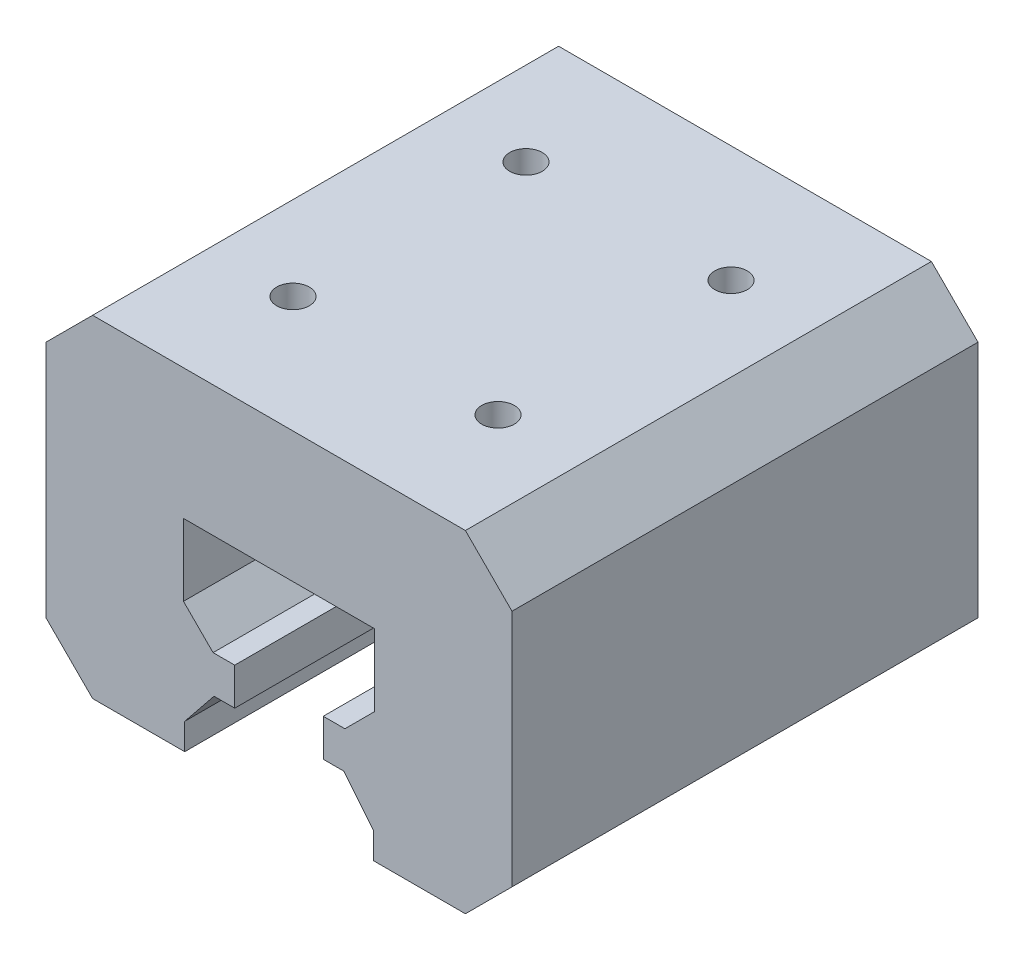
ISO-10303-21;
HEADER;
FILE_DESCRIPTION(('STEP AP214'),'2;1');
FILE_NAME('part.step','',(''),(''),'','','');
FILE_SCHEMA(('AUTOMOTIVE_DESIGN { 1 0 10303 214 1 1 1 1 }'));
ENDSEC;
DATA;
#1=APPLICATION_CONTEXT('core data for automotive mechanical design processes');
#2=APPLICATION_PROTOCOL_DEFINITION('international standard','automotive_design',2000,#1);
#3=PRODUCT_CONTEXT('',#1,'mechanical');
#4=PRODUCT('Part','Part','',(#3));
#5=PRODUCT_RELATED_PRODUCT_CATEGORY('part','',(#4));
#6=PRODUCT_DEFINITION_FORMATION('','',#4);
#7=PRODUCT_DEFINITION_CONTEXT('part definition',#1,'design');
#8=PRODUCT_DEFINITION('design','',#6,#7);
#9=PRODUCT_DEFINITION_SHAPE('','',#8);
#10=(LENGTH_UNIT() NAMED_UNIT(*) SI_UNIT(.MILLI.,.METRE.));
#11=(NAMED_UNIT(*) PLANE_ANGLE_UNIT() SI_UNIT($,.RADIAN.));
#12=(NAMED_UNIT(*) SI_UNIT($,.STERADIAN.) SOLID_ANGLE_UNIT());
#13=UNCERTAINTY_MEASURE_WITH_UNIT(LENGTH_MEASURE(1.E-05),#10,'distance_accuracy_value','');
#14=(GEOMETRIC_REPRESENTATION_CONTEXT(3) GLOBAL_UNCERTAINTY_ASSIGNED_CONTEXT((#13)) GLOBAL_UNIT_ASSIGNED_CONTEXT((#10,
#11,#12)) REPRESENTATION_CONTEXT('',''));
#15=CARTESIAN_POINT('',(0.,0.,0.));
#16=DIRECTION('',(0.,0.,1.));
#17=DIRECTION('',(1.,0.,0.));
#18=AXIS2_PLACEMENT_3D('',#15,#16,#17);
#19=CARTESIAN_POINT('',(31.192287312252,71.2311611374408,100.));
#20=DIRECTION('',(1.,0.,0.));
#21=DIRECTION('',(0.,0.,-1.));
#22=AXIS2_PLACEMENT_3D('',#19,#20,#21);
#23=PLANE('',#22);
#24=DIRECTION('',(0.,-1.,0.));
#25=VECTOR('',#24,1.);
#26=CARTESIAN_POINT('',(31.192287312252,71.2311611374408,100.));
#27=LINE('',#26,#25);
#28=CARTESIAN_POINT('',(31.192287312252,61.2311611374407,100.));
#29=VERTEX_POINT('',#28);
#30=CARTESIAN_POINT('',(31.192287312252,10.,100.));
#31=VERTEX_POINT('',#30);
#32=EDGE_CURVE('E240',#29,#31,#27,.T.);
#33=ORIENTED_EDGE('',*,*,#32,.T.);
#34=DIRECTION('',(0.,0.,-1.));
#35=VECTOR('',#34,1.);
#36=CARTESIAN_POINT('',(31.192287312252,9.99999999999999,100.));
#37=LINE('',#36,#35);
#38=CARTESIAN_POINT('',(31.192287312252,10.,0.));
#39=VERTEX_POINT('',#38);
#40=EDGE_CURVE('E407',#31,#39,#37,.T.);
#41=ORIENTED_EDGE('',*,*,#40,.T.);
#42=DIRECTION('',(0.,-1.,0.));
#43=VECTOR('',#42,1.);
#44=CARTESIAN_POINT('',(31.192287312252,71.2311611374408,0.));
#45=LINE('',#44,#43);
#46=CARTESIAN_POINT('',(31.192287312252,61.2311611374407,0.));
#47=VERTEX_POINT('',#46);
#48=EDGE_CURVE('E239',#47,#39,#45,.T.);
#49=ORIENTED_EDGE('',*,*,#48,.F.);
#50=DIRECTION('',(0.,0.,1.));
#51=VECTOR('',#50,1.);
#52=CARTESIAN_POINT('',(31.192287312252,61.2311611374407,100.));
#53=LINE('',#52,#51);
#54=EDGE_CURVE('E385',#47,#29,#53,.T.);
#55=ORIENTED_EDGE('',*,*,#54,.T.);
#56=EDGE_LOOP('',(#33,#41,#49,#55));
#57=FACE_BOUND('',#56,.T.);
#58=ADVANCED_FACE('F37',(#57),#23,.T.);
#59=CARTESIAN_POINT('',(31.192287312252,71.2311611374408,100.));
#60=DIRECTION('',(0.,-1.,0.));
#61=DIRECTION('',(1.,0.,0.));
#62=AXIS2_PLACEMENT_3D('',#59,#60,#61);
#63=PLANE('',#62);
#64=CARTESIAN_POINT('',(-40.807712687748,71.2311611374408,75.));
#65=DIRECTION('',(0.,1.,0.));
#66=DIRECTION('',(0.,0.,1.));
#67=AXIS2_PLACEMENT_3D('',#64,#65,#66);
#68=CIRCLE('',#67,3.5);
#69=CARTESIAN_POINT('',(-40.807712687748,71.2311611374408,78.5));
#70=VERTEX_POINT('',#69);
#71=EDGE_CURVE('E217',#70,#70,#68,.T.);
#72=ORIENTED_EDGE('',*,*,#71,.F.);
#73=EDGE_LOOP('',(#72));
#74=FACE_BOUND('',#73,.T.);
#75=CARTESIAN_POINT('',(3.19228731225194,71.2311611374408,75.));
#76=DIRECTION('',(0.,1.,0.));
#77=DIRECTION('',(0.,0.,1.));
#78=AXIS2_PLACEMENT_3D('',#75,#76,#77);
#79=CIRCLE('',#78,3.5);
#80=CARTESIAN_POINT('',(3.19228731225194,71.2311611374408,78.5));
#81=VERTEX_POINT('',#80);
#82=EDGE_CURVE('E216',#81,#81,#79,.T.);
#83=ORIENTED_EDGE('',*,*,#82,.F.);
#84=EDGE_LOOP('',(#83));
#85=FACE_BOUND('',#84,.T.);
#86=CARTESIAN_POINT('',(3.19228731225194,71.2311611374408,25.));
#87=DIRECTION('',(0.,1.,0.));
#88=DIRECTION('',(0.,0.,1.));
#89=AXIS2_PLACEMENT_3D('',#86,#87,#88);
#90=CIRCLE('',#89,3.5);
#91=CARTESIAN_POINT('',(3.19228731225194,71.2311611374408,28.5));
#92=VERTEX_POINT('',#91);
#93=EDGE_CURVE('E227',#92,#92,#90,.T.);
#94=ORIENTED_EDGE('',*,*,#93,.F.);
#95=EDGE_LOOP('',(#94));
#96=FACE_BOUND('',#95,.T.);
#97=CARTESIAN_POINT('',(-40.807712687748,71.2311611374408,25.));
#98=DIRECTION('',(0.,1.,0.));
#99=DIRECTION('',(0.,0.,1.));
#100=AXIS2_PLACEMENT_3D('',#97,#98,#99);
#101=CIRCLE('',#100,3.5);
#102=CARTESIAN_POINT('',(-40.807712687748,71.2311611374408,28.5));
#103=VERTEX_POINT('',#102);
#104=EDGE_CURVE('E233',#103,#103,#101,.T.);
#105=ORIENTED_EDGE('',*,*,#104,.F.);
#106=EDGE_LOOP('',(#105));
#107=FACE_BOUND('',#106,.T.);
#108=DIRECTION('',(-1.,0.,0.));
#109=VECTOR('',#108,1.);
#110=CARTESIAN_POINT('',(31.192287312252,71.2311611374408,0.));
#111=LINE('',#110,#109);
#112=CARTESIAN_POINT('',(21.192287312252,71.2311611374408,0.));
#113=VERTEX_POINT('',#112);
#114=CARTESIAN_POINT('',(-58.807712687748,71.2311611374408,0.));
#115=VERTEX_POINT('',#114);
#116=EDGE_CURVE('E244',#113,#115,#111,.T.);
#117=ORIENTED_EDGE('',*,*,#116,.T.);
#118=DIRECTION('',(0.,0.,1.));
#119=VECTOR('',#118,1.);
#120=CARTESIAN_POINT('',(-58.807712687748,71.2311611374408,100.));
#121=LINE('',#120,#119);
#122=CARTESIAN_POINT('',(-58.807712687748,71.2311611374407,100.));
#123=VERTEX_POINT('',#122);
#124=EDGE_CURVE('E394',#115,#123,#121,.T.);
#125=ORIENTED_EDGE('',*,*,#124,.T.);
#126=DIRECTION('',(-1.,0.,0.));
#127=VECTOR('',#126,1.);
#128=CARTESIAN_POINT('',(31.192287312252,71.2311611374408,100.));
#129=LINE('',#128,#127);
#130=CARTESIAN_POINT('',(21.192287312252,71.2311611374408,100.));
#131=VERTEX_POINT('',#130);
#132=EDGE_CURVE('E288',#131,#123,#129,.T.);
#133=ORIENTED_EDGE('',*,*,#132,.F.);
#134=DIRECTION('',(0.,0.,-1.));
#135=VECTOR('',#134,1.);
#136=CARTESIAN_POINT('',(21.192287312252,71.2311611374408,0.));
#137=LINE('',#136,#135);
#138=EDGE_CURVE('E343',#131,#113,#137,.T.);
#139=ORIENTED_EDGE('',*,*,#138,.T.);
#140=EDGE_LOOP('',(#117,#125,#133,#139));
#141=FACE_BOUND('',#140,.T.);
#142=ADVANCED_FACE('F425',(#74,#85,#96,#107,#141),#63,.F.);
#143=CARTESIAN_POINT('',(-68.807712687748,71.2311611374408,100.));
#144=DIRECTION('',(1.,0.,0.));
#145=DIRECTION('',(0.,1.,0.));
#146=AXIS2_PLACEMENT_3D('',#143,#144,#145);
#147=PLANE('',#146);
#148=DIRECTION('',(0.,-1.,0.));
#149=VECTOR('',#148,1.);
#150=CARTESIAN_POINT('',(-68.807712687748,71.2311611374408,0.));
#151=LINE('',#150,#149);
#152=CARTESIAN_POINT('',(-68.807712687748,61.2311611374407,0.));
#153=VERTEX_POINT('',#152);
#154=CARTESIAN_POINT('',(-68.807712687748,10.,0.));
#155=VERTEX_POINT('',#154);
#156=EDGE_CURVE('E335',#153,#155,#151,.T.);
#157=ORIENTED_EDGE('',*,*,#156,.T.);
#158=DIRECTION('',(0.,0.,1.));
#159=VECTOR('',#158,1.);
#160=CARTESIAN_POINT('',(-68.807712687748,10.,100.));
#161=LINE('',#160,#159);
#162=CARTESIAN_POINT('',(-68.807712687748,10.0000000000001,100.));
#163=VERTEX_POINT('',#162);
#164=EDGE_CURVE('E403',#155,#163,#161,.T.);
#165=ORIENTED_EDGE('',*,*,#164,.T.);
#166=DIRECTION('',(0.,-1.,0.));
#167=VECTOR('',#166,1.);
#168=CARTESIAN_POINT('',(-68.807712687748,71.2311611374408,100.));
#169=LINE('',#168,#167);
#170=CARTESIAN_POINT('',(-68.807712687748,61.2311611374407,100.));
#171=VERTEX_POINT('',#170);
#172=EDGE_CURVE('E285',#171,#163,#169,.T.);
#173=ORIENTED_EDGE('',*,*,#172,.F.);
#174=DIRECTION('',(0.,0.,-1.));
#175=VECTOR('',#174,1.);
#176=CARTESIAN_POINT('',(-68.807712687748,61.2311611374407,100.));
#177=LINE('',#176,#175);
#178=EDGE_CURVE('E389',#171,#153,#177,.T.);
#179=ORIENTED_EDGE('',*,*,#178,.T.);
#180=EDGE_LOOP('',(#157,#165,#173,#179));
#181=FACE_BOUND('',#180,.T.);
#182=ADVANCED_FACE('F436',(#181),#147,.F.);
#183=CARTESIAN_POINT('',(-68.807712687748,0.,100.));
#184=DIRECTION('',(0.,1.,0.));
#185=DIRECTION('',(0.,0.,1.));
#186=AXIS2_PLACEMENT_3D('',#183,#184,#185);
#187=PLANE('',#186);
#188=DIRECTION('',(1.,0.,0.));
#189=VECTOR('',#188,1.);
#190=CARTESIAN_POINT('',(-68.807712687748,0.,100.));
#191=LINE('',#190,#189);
#192=CARTESIAN_POINT('',(-58.807712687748,0.,100.));
#193=VERTEX_POINT('',#192);
#194=CARTESIAN_POINT('',(-39.0437937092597,0.,100.));
#195=VERTEX_POINT('',#194);
#196=EDGE_CURVE('E283',#193,#195,#191,.T.);
#197=ORIENTED_EDGE('',*,*,#196,.F.);
#198=DIRECTION('',(0.,0.,-1.));
#199=VECTOR('',#198,1.);
#200=CARTESIAN_POINT('',(-58.807712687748,0.,100.));
#201=LINE('',#200,#199);
#202=CARTESIAN_POINT('',(-58.807712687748,0.,0.));
#203=VERTEX_POINT('',#202);
#204=EDGE_CURVE('E398',#193,#203,#201,.T.);
#205=ORIENTED_EDGE('',*,*,#204,.T.);
#206=DIRECTION('',(1.,0.,0.));
#207=VECTOR('',#206,1.);
#208=CARTESIAN_POINT('',(-68.807712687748,0.,0.));
#209=LINE('',#208,#207);
#210=CARTESIAN_POINT('',(-39.0437937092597,0.,0.));
#211=VERTEX_POINT('',#210);
#212=EDGE_CURVE('E333',#203,#211,#209,.T.);
#213=ORIENTED_EDGE('',*,*,#212,.T.);
#214=DIRECTION('',(0.,0.,-1.));
#215=VECTOR('',#214,1.);
#216=CARTESIAN_POINT('',(-39.0437937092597,0.,100.));
#217=LINE('',#216,#215);
#218=EDGE_CURVE('E340',#195,#211,#217,.T.);
#219=ORIENTED_EDGE('',*,*,#218,.F.);
#220=EDGE_LOOP('',(#197,#205,#213,#219));
#221=FACE_BOUND('',#220,.T.);
#222=ADVANCED_FACE('F446',(#221),#187,.F.);
#223=CARTESIAN_POINT('',(-39.0437937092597,0.,100.));
#224=DIRECTION('',(-1.,0.,0.));
#225=DIRECTION('',(0.,0.,1.));
#226=AXIS2_PLACEMENT_3D('',#223,#224,#225);
#227=PLANE('',#226);
#228=DIRECTION('',(0.,1.,0.));
#229=VECTOR('',#228,1.);
#230=CARTESIAN_POINT('',(-39.0437937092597,0.,0.));
#231=LINE('',#230,#229);
#232=CARTESIAN_POINT('',(-39.0437937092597,5.64651643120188,0.));
#233=VERTEX_POINT('',#232);
#234=EDGE_CURVE('E331',#211,#233,#231,.T.);
#235=ORIENTED_EDGE('',*,*,#234,.T.);
#236=DIRECTION('',(0.,0.,-1.));
#237=VECTOR('',#236,1.);
#238=CARTESIAN_POINT('',(-39.0437937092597,5.64651643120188,100.));
#239=LINE('',#238,#237);
#240=CARTESIAN_POINT('',(-39.0437937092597,5.64651643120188,100.));
#241=VERTEX_POINT('',#240);
#242=EDGE_CURVE('E344',#241,#233,#239,.T.);
#243=ORIENTED_EDGE('',*,*,#242,.F.);
#244=DIRECTION('',(0.,1.,0.));
#245=VECTOR('',#244,1.);
#246=CARTESIAN_POINT('',(-39.0437937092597,0.,100.));
#247=LINE('',#246,#245);
#248=EDGE_CURVE('E281',#195,#241,#247,.T.);
#249=ORIENTED_EDGE('',*,*,#248,.F.);
#250=ORIENTED_EDGE('',*,*,#218,.T.);
#251=EDGE_LOOP('',(#235,#243,#249,#250));
#252=FACE_BOUND('',#251,.T.);
#253=ADVANCED_FACE('F453',(#252),#227,.F.);
#254=CARTESIAN_POINT('',(-39.0437937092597,5.64651643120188,100.));
#255=DIRECTION('',(-0.77901425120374,0.627006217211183,0.));
#256=DIRECTION('',(-0.627006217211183,-0.77901425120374,0.));
#257=AXIS2_PLACEMENT_3D('',#254,#255,#256);
#258=PLANE('',#257);
#259=DIRECTION('',(0.627006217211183,0.77901425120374,0.));
#260=VECTOR('',#259,1.);
#261=CARTESIAN_POINT('',(-39.0437937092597,5.64651643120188,0.));
#262=LINE('',#261,#260);
#263=CARTESIAN_POINT('',(-32.7533796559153,13.4619448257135,0.));
#264=VERTEX_POINT('',#263);
#265=EDGE_CURVE('E329',#233,#264,#262,.T.);
#266=ORIENTED_EDGE('',*,*,#265,.T.);
#267=DIRECTION('',(0.,0.,-1.));
#268=VECTOR('',#267,1.);
#269=CARTESIAN_POINT('',(-32.7533796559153,13.4619448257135,100.));
#270=LINE('',#269,#268);
#271=CARTESIAN_POINT('',(-32.7533796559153,13.4619448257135,100.));
#272=VERTEX_POINT('',#271);
#273=EDGE_CURVE('E347',#272,#264,#270,.T.);
#274=ORIENTED_EDGE('',*,*,#273,.F.);
#275=DIRECTION('',(0.627006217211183,0.77901425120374,0.));
#276=VECTOR('',#275,1.);
#277=CARTESIAN_POINT('',(-39.0437937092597,5.64651643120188,100.));
#278=LINE('',#277,#276);
#279=EDGE_CURVE('E279',#241,#272,#278,.T.);
#280=ORIENTED_EDGE('',*,*,#279,.F.);
#281=ORIENTED_EDGE('',*,*,#242,.T.);
#282=EDGE_LOOP('',(#266,#274,#280,#281));
#283=FACE_BOUND('',#282,.T.);
#284=ADVANCED_FACE('F456',(#283),#258,.F.);
#285=CARTESIAN_POINT('',(-32.7533796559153,13.4619448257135,100.));
#286=DIRECTION('',(0.,1.,0.));
#287=DIRECTION('',(-1.,0.,0.));
#288=AXIS2_PLACEMENT_3D('',#285,#286,#287);
#289=PLANE('',#288);
#290=DIRECTION('',(1.,0.,0.));
#291=VECTOR('',#290,1.);
#292=CARTESIAN_POINT('',(-32.7533796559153,13.4619448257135,0.));
#293=LINE('',#292,#291);
#294=CARTESIAN_POINT('',(-28.307712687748,13.4619448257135,0.));
#295=VERTEX_POINT('',#294);
#296=EDGE_CURVE('E327',#264,#295,#293,.T.);
#297=ORIENTED_EDGE('',*,*,#296,.T.);
#298=DIRECTION('',(0.,0.,-1.));
#299=VECTOR('',#298,1.);
#300=CARTESIAN_POINT('',(-28.307712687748,13.4619448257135,100.));
#301=LINE('',#300,#299);
#302=CARTESIAN_POINT('',(-28.307712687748,13.4619448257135,100.));
#303=VERTEX_POINT('',#302);
#304=EDGE_CURVE('E350',#303,#295,#301,.T.);
#305=ORIENTED_EDGE('',*,*,#304,.F.);
#306=DIRECTION('',(1.,0.,0.));
#307=VECTOR('',#306,1.);
#308=CARTESIAN_POINT('',(-32.7533796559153,13.4619448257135,100.));
#309=LINE('',#308,#307);
#310=EDGE_CURVE('E277',#272,#303,#309,.T.);
#311=ORIENTED_EDGE('',*,*,#310,.F.);
#312=ORIENTED_EDGE('',*,*,#273,.T.);
#313=EDGE_LOOP('',(#297,#305,#311,#312));
#314=FACE_BOUND('',#313,.T.);
#315=ADVANCED_FACE('F461',(#314),#289,.F.);
#316=CARTESIAN_POINT('',(-28.307712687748,13.4619448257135,100.));
#317=DIRECTION('',(-1.,0.,0.));
#318=DIRECTION('',(0.,-1.,0.));
#319=AXIS2_PLACEMENT_3D('',#316,#317,#318);
#320=PLANE('',#319);
#321=DIRECTION('',(0.,1.,0.));
#322=VECTOR('',#321,1.);
#323=CARTESIAN_POINT('',(-28.307712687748,13.4619448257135,0.));
#324=LINE('',#323,#322);
#325=CARTESIAN_POINT('',(-28.307712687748,21.4619448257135,0.));
#326=VERTEX_POINT('',#325);
#327=EDGE_CURVE('E325',#295,#326,#324,.T.);
#328=ORIENTED_EDGE('',*,*,#327,.T.);
#329=DIRECTION('',(0.,0.,-1.));
#330=VECTOR('',#329,1.);
#331=CARTESIAN_POINT('',(-28.307712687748,21.4619448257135,100.));
#332=LINE('',#331,#330);
#333=CARTESIAN_POINT('',(-28.307712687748,21.4619448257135,100.));
#334=VERTEX_POINT('',#333);
#335=EDGE_CURVE('E353',#334,#326,#332,.T.);
#336=ORIENTED_EDGE('',*,*,#335,.F.);
#337=DIRECTION('',(0.,1.,0.));
#338=VECTOR('',#337,1.);
#339=CARTESIAN_POINT('',(-28.307712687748,13.4619448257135,100.));
#340=LINE('',#339,#338);
#341=EDGE_CURVE('E275',#303,#334,#340,.T.);
#342=ORIENTED_EDGE('',*,*,#341,.F.);
#343=ORIENTED_EDGE('',*,*,#304,.T.);
#344=EDGE_LOOP('',(#328,#336,#342,#343));
#345=FACE_BOUND('',#344,.T.);
#346=ADVANCED_FACE('F467',(#345),#320,.F.);
#347=CARTESIAN_POINT('',(-28.307712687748,21.4619448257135,100.));
#348=DIRECTION('',(0.,-1.,0.));
#349=DIRECTION('',(1.,0.,0.));
#350=AXIS2_PLACEMENT_3D('',#347,#348,#349);
#351=PLANE('',#350);
#352=DIRECTION('',(-1.,0.,0.));
#353=VECTOR('',#352,1.);
#354=CARTESIAN_POINT('',(-28.307712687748,21.4619448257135,0.));
#355=LINE('',#354,#353);
#356=CARTESIAN_POINT('',(-32.9527099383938,21.4619448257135,0.));
#357=VERTEX_POINT('',#356);
#358=EDGE_CURVE('E323',#326,#357,#355,.T.);
#359=ORIENTED_EDGE('',*,*,#358,.T.);
#360=DIRECTION('',(0.,0.,-1.));
#361=VECTOR('',#360,1.);
#362=CARTESIAN_POINT('',(-32.9527099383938,21.4619448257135,100.));
#363=LINE('',#362,#361);
#364=CARTESIAN_POINT('',(-32.9527099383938,21.4619448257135,100.));
#365=VERTEX_POINT('',#364);
#366=EDGE_CURVE('E356',#365,#357,#363,.T.);
#367=ORIENTED_EDGE('',*,*,#366,.F.);
#368=DIRECTION('',(-1.,0.,0.));
#369=VECTOR('',#368,1.);
#370=CARTESIAN_POINT('',(-28.307712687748,21.4619448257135,100.));
#371=LINE('',#370,#369);
#372=EDGE_CURVE('E273',#334,#365,#371,.T.);
#373=ORIENTED_EDGE('',*,*,#372,.F.);
#374=ORIENTED_EDGE('',*,*,#335,.T.);
#375=EDGE_LOOP('',(#359,#367,#373,#374));
#376=FACE_BOUND('',#375,.T.);
#377=ADVANCED_FACE('F471',(#376),#351,.F.);
#378=CARTESIAN_POINT('',(-32.9527099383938,21.4619448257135,100.));
#379=DIRECTION('',(-0.707106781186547,-0.707106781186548,0.));
#380=DIRECTION('',(0.707106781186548,-0.707106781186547,0.));
#381=AXIS2_PLACEMENT_3D('',#378,#379,#380);
#382=PLANE('',#381);
#383=DIRECTION('',(-0.707106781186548,0.707106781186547,0.));
#384=VECTOR('',#383,1.);
#385=CARTESIAN_POINT('',(-32.9527099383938,21.4619448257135,0.));
#386=LINE('',#385,#384);
#387=CARTESIAN_POINT('',(-39.307712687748,27.8169475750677,0.));
#388=VERTEX_POINT('',#387);
#389=EDGE_CURVE('E321',#357,#388,#386,.T.);
#390=ORIENTED_EDGE('',*,*,#389,.T.);
#391=DIRECTION('',(0.,0.,-1.));
#392=VECTOR('',#391,1.);
#393=CARTESIAN_POINT('',(-39.307712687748,27.8169475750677,100.));
#394=LINE('',#393,#392);
#395=CARTESIAN_POINT('',(-39.307712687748,27.8169475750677,100.));
#396=VERTEX_POINT('',#395);
#397=EDGE_CURVE('E359',#396,#388,#394,.T.);
#398=ORIENTED_EDGE('',*,*,#397,.F.);
#399=DIRECTION('',(-0.707106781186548,0.707106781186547,0.));
#400=VECTOR('',#399,1.);
#401=CARTESIAN_POINT('',(-32.9527099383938,21.4619448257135,100.));
#402=LINE('',#401,#400);
#403=EDGE_CURVE('E271',#365,#396,#402,.T.);
#404=ORIENTED_EDGE('',*,*,#403,.F.);
#405=ORIENTED_EDGE('',*,*,#366,.T.);
#406=EDGE_LOOP('',(#390,#398,#404,#405));
#407=FACE_BOUND('',#406,.T.);
#408=ADVANCED_FACE('F476',(#407),#382,.F.);
#409=CARTESIAN_POINT('',(-39.307712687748,27.8169475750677,100.));
#410=DIRECTION('',(-1.,0.,0.));
#411=DIRECTION('',(0.,-1.,0.));
#412=AXIS2_PLACEMENT_3D('',#409,#410,#411);
#413=PLANE('',#412);
#414=DIRECTION('',(0.,1.,0.));
#415=VECTOR('',#414,1.);
#416=CARTESIAN_POINT('',(-39.307712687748,27.8169475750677,0.));
#417=LINE('',#416,#415);
#418=CARTESIAN_POINT('',(-39.307712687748,43.2311611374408,0.));
#419=VERTEX_POINT('',#418);
#420=EDGE_CURVE('E319',#388,#419,#417,.T.);
#421=ORIENTED_EDGE('',*,*,#420,.T.);
#422=DIRECTION('',(0.,0.,-1.));
#423=VECTOR('',#422,1.);
#424=CARTESIAN_POINT('',(-39.307712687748,43.2311611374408,100.));
#425=LINE('',#424,#423);
#426=CARTESIAN_POINT('',(-39.307712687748,43.2311611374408,100.));
#427=VERTEX_POINT('',#426);
#428=EDGE_CURVE('E362',#427,#419,#425,.T.);
#429=ORIENTED_EDGE('',*,*,#428,.F.);
#430=DIRECTION('',(0.,1.,0.));
#431=VECTOR('',#430,1.);
#432=CARTESIAN_POINT('',(-39.307712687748,27.8169475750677,100.));
#433=LINE('',#432,#431);
#434=EDGE_CURVE('E269',#396,#427,#433,.T.);
#435=ORIENTED_EDGE('',*,*,#434,.F.);
#436=ORIENTED_EDGE('',*,*,#397,.T.);
#437=EDGE_LOOP('',(#421,#429,#435,#436));
#438=FACE_BOUND('',#437,.T.);
#439=ADVANCED_FACE('F483',(#438),#413,.F.);
#440=CARTESIAN_POINT('',(-39.307712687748,43.2311611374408,100.));
#441=DIRECTION('',(0.,1.,0.));
#442=DIRECTION('',(-1.,0.,0.));
#443=AXIS2_PLACEMENT_3D('',#440,#441,#442);
#444=PLANE('',#443);
#445=DIRECTION('',(1.,0.,0.));
#446=VECTOR('',#445,1.);
#447=CARTESIAN_POINT('',(-39.307712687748,43.2311611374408,0.));
#448=LINE('',#447,#446);
#449=CARTESIAN_POINT('',(1.69228731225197,43.2311611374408,0.));
#450=VERTEX_POINT('',#449);
#451=EDGE_CURVE('E316',#419,#450,#448,.T.);
#452=ORIENTED_EDGE('',*,*,#451,.T.);
#453=DIRECTION('',(0.,0.,-1.));
#454=VECTOR('',#453,1.);
#455=CARTESIAN_POINT('',(1.69228731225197,43.2311611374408,100.));
#456=LINE('',#455,#454);
#457=CARTESIAN_POINT('',(1.69228731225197,43.2311611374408,100.));
#458=VERTEX_POINT('',#457);
#459=EDGE_CURVE('E365',#458,#450,#456,.T.);
#460=ORIENTED_EDGE('',*,*,#459,.F.);
#461=DIRECTION('',(1.,0.,0.));
#462=VECTOR('',#461,1.);
#463=CARTESIAN_POINT('',(-39.307712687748,43.2311611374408,100.));
#464=LINE('',#463,#462);
#465=EDGE_CURVE('E267',#427,#458,#464,.T.);
#466=ORIENTED_EDGE('',*,*,#465,.F.);
#467=ORIENTED_EDGE('',*,*,#428,.T.);
#468=EDGE_LOOP('',(#452,#460,#466,#467));
#469=FACE_BOUND('',#468,.T.);
#470=ADVANCED_FACE('F487',(#469),#444,.F.);
#471=CARTESIAN_POINT('',(1.69228731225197,27.8169475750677,100.));
#472=DIRECTION('',(-1.,0.,0.));
#473=DIRECTION('',(0.,0.,1.));
#474=AXIS2_PLACEMENT_3D('',#471,#472,#473);
#475=PLANE('',#474);
#476=DIRECTION('',(0.,1.,0.));
#477=VECTOR('',#476,1.);
#478=CARTESIAN_POINT('',(1.69228731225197,27.8169475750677,0.));
#479=LINE('',#478,#477);
#480=CARTESIAN_POINT('',(1.69228731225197,27.8169475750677,0.));
#481=VERTEX_POINT('',#480);
#482=EDGE_CURVE('E313',#481,#450,#479,.T.);
#483=ORIENTED_EDGE('',*,*,#482,.F.);
#484=DIRECTION('',(0.,0.,-1.));
#485=VECTOR('',#484,1.);
#486=CARTESIAN_POINT('',(1.69228731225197,27.8169475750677,100.));
#487=LINE('',#486,#485);
#488=CARTESIAN_POINT('',(1.69228731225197,27.8169475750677,100.));
#489=VERTEX_POINT('',#488);
#490=EDGE_CURVE('E367',#489,#481,#487,.T.);
#491=ORIENTED_EDGE('',*,*,#490,.F.);
#492=DIRECTION('',(0.,1.,0.));
#493=VECTOR('',#492,1.);
#494=CARTESIAN_POINT('',(1.69228731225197,27.8169475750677,100.));
#495=LINE('',#494,#493);
#496=EDGE_CURVE('E264',#489,#458,#495,.T.);
#497=ORIENTED_EDGE('',*,*,#496,.T.);
#498=ORIENTED_EDGE('',*,*,#459,.T.);
#499=EDGE_LOOP('',(#483,#491,#497,#498));
#500=FACE_BOUND('',#499,.T.);
#501=ADVANCED_FACE('F490',(#500),#475,.T.);
#502=CARTESIAN_POINT('',(-4.66271543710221,21.4619448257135,100.));
#503=DIRECTION('',(-0.707106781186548,0.707106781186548,0.));
#504=DIRECTION('',(-0.707106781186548,-0.707106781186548,0.));
#505=AXIS2_PLACEMENT_3D('',#502,#503,#504);
#506=PLANE('',#505);
#507=DIRECTION('',(0.707106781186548,0.707106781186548,0.));
#508=VECTOR('',#507,1.);
#509=CARTESIAN_POINT('',(-4.66271543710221,21.4619448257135,0.));
#510=LINE('',#509,#508);
#511=CARTESIAN_POINT('',(-4.66271543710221,21.4619448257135,0.));
#512=VERTEX_POINT('',#511);
#513=EDGE_CURVE('E310',#512,#481,#510,.T.);
#514=ORIENTED_EDGE('',*,*,#513,.F.);
#515=DIRECTION('',(0.,0.,-1.));
#516=VECTOR('',#515,1.);
#517=CARTESIAN_POINT('',(-4.66271543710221,21.4619448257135,100.));
#518=LINE('',#517,#516);
#519=CARTESIAN_POINT('',(-4.66271543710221,21.4619448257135,100.));
#520=VERTEX_POINT('',#519);
#521=EDGE_CURVE('E369',#520,#512,#518,.T.);
#522=ORIENTED_EDGE('',*,*,#521,.F.);
#523=DIRECTION('',(0.707106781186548,0.707106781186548,0.));
#524=VECTOR('',#523,1.);
#525=CARTESIAN_POINT('',(-4.66271543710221,21.4619448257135,100.));
#526=LINE('',#525,#524);
#527=EDGE_CURVE('E261',#520,#489,#526,.T.);
#528=ORIENTED_EDGE('',*,*,#527,.T.);
#529=ORIENTED_EDGE('',*,*,#490,.T.);
#530=EDGE_LOOP('',(#514,#522,#528,#529));
#531=FACE_BOUND('',#530,.T.);
#532=ADVANCED_FACE('F495',(#531),#506,.T.);
#533=CARTESIAN_POINT('',(-9.30771268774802,21.4619448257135,100.));
#534=DIRECTION('',(0.,1.,0.));
#535=DIRECTION('',(0.,0.,1.));
#536=AXIS2_PLACEMENT_3D('',#533,#534,#535);
#537=PLANE('',#536);
#538=DIRECTION('',(1.,0.,0.));
#539=VECTOR('',#538,1.);
#540=CARTESIAN_POINT('',(-9.30771268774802,21.4619448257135,0.));
#541=LINE('',#540,#539);
#542=CARTESIAN_POINT('',(-9.30771268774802,21.4619448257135,0.));
#543=VERTEX_POINT('',#542);
#544=EDGE_CURVE('E307',#543,#512,#541,.T.);
#545=ORIENTED_EDGE('',*,*,#544,.F.);
#546=DIRECTION('',(0.,0.,-1.));
#547=VECTOR('',#546,1.);
#548=CARTESIAN_POINT('',(-9.30771268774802,21.4619448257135,100.));
#549=LINE('',#548,#547);
#550=CARTESIAN_POINT('',(-9.30771268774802,21.4619448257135,100.));
#551=VERTEX_POINT('',#550);
#552=EDGE_CURVE('E371',#551,#543,#549,.T.);
#553=ORIENTED_EDGE('',*,*,#552,.F.);
#554=DIRECTION('',(1.,0.,0.));
#555=VECTOR('',#554,1.);
#556=CARTESIAN_POINT('',(-9.30771268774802,21.4619448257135,100.));
#557=LINE('',#556,#555);
#558=EDGE_CURVE('E258',#551,#520,#557,.T.);
#559=ORIENTED_EDGE('',*,*,#558,.T.);
#560=ORIENTED_EDGE('',*,*,#521,.T.);
#561=EDGE_LOOP('',(#545,#553,#559,#560));
#562=FACE_BOUND('',#561,.T.);
#563=ADVANCED_FACE('F498',(#562),#537,.T.);
#564=CARTESIAN_POINT('',(-9.30771268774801,13.4619448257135,100.));
#565=DIRECTION('',(-1.,0.,0.));
#566=DIRECTION('',(0.,-1.,0.));
#567=AXIS2_PLACEMENT_3D('',#564,#565,#566);
#568=PLANE('',#567);
#569=DIRECTION('',(0.,1.,0.));
#570=VECTOR('',#569,1.);
#571=CARTESIAN_POINT('',(-9.30771268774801,13.4619448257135,0.));
#572=LINE('',#571,#570);
#573=CARTESIAN_POINT('',(-9.30771268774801,13.4619448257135,0.));
#574=VERTEX_POINT('',#573);
#575=EDGE_CURVE('E304',#574,#543,#572,.T.);
#576=ORIENTED_EDGE('',*,*,#575,.F.);
#577=DIRECTION('',(0.,0.,-1.));
#578=VECTOR('',#577,1.);
#579=CARTESIAN_POINT('',(-9.30771268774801,13.4619448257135,100.));
#580=LINE('',#579,#578);
#581=CARTESIAN_POINT('',(-9.30771268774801,13.4619448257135,100.));
#582=VERTEX_POINT('',#581);
#583=EDGE_CURVE('E373',#582,#574,#580,.T.);
#584=ORIENTED_EDGE('',*,*,#583,.F.);
#585=DIRECTION('',(0.,1.,0.));
#586=VECTOR('',#585,1.);
#587=CARTESIAN_POINT('',(-9.30771268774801,13.4619448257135,100.));
#588=LINE('',#587,#586);
#589=EDGE_CURVE('E255',#582,#551,#588,.T.);
#590=ORIENTED_EDGE('',*,*,#589,.T.);
#591=ORIENTED_EDGE('',*,*,#552,.T.);
#592=EDGE_LOOP('',(#576,#584,#590,#591));
#593=FACE_BOUND('',#592,.T.);
#594=ADVANCED_FACE('F503',(#593),#568,.T.);
#595=CARTESIAN_POINT('',(-4.86204571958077,13.4619448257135,100.));
#596=DIRECTION('',(0.,-1.,0.));
#597=DIRECTION('',(1.,0.,0.));
#598=AXIS2_PLACEMENT_3D('',#595,#596,#597);
#599=PLANE('',#598);
#600=DIRECTION('',(-1.,0.,0.));
#601=VECTOR('',#600,1.);
#602=CARTESIAN_POINT('',(-4.86204571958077,13.4619448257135,0.));
#603=LINE('',#602,#601);
#604=CARTESIAN_POINT('',(-4.86204571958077,13.4619448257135,0.));
#605=VERTEX_POINT('',#604);
#606=EDGE_CURVE('E301',#605,#574,#603,.T.);
#607=ORIENTED_EDGE('',*,*,#606,.F.);
#608=DIRECTION('',(0.,0.,-1.));
#609=VECTOR('',#608,1.);
#610=CARTESIAN_POINT('',(-4.86204571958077,13.4619448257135,100.));
#611=LINE('',#610,#609);
#612=CARTESIAN_POINT('',(-4.86204571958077,13.4619448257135,100.));
#613=VERTEX_POINT('',#612);
#614=EDGE_CURVE('E375',#613,#605,#611,.T.);
#615=ORIENTED_EDGE('',*,*,#614,.F.);
#616=DIRECTION('',(-1.,0.,0.));
#617=VECTOR('',#616,1.);
#618=CARTESIAN_POINT('',(-4.86204571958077,13.4619448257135,100.));
#619=LINE('',#618,#617);
#620=EDGE_CURVE('E252',#613,#582,#619,.T.);
#621=ORIENTED_EDGE('',*,*,#620,.T.);
#622=ORIENTED_EDGE('',*,*,#583,.T.);
#623=EDGE_LOOP('',(#607,#615,#621,#622));
#624=FACE_BOUND('',#623,.T.);
#625=ADVANCED_FACE('F506',(#624),#599,.T.);
#626=CARTESIAN_POINT('',(1.42836833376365,5.64651643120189,100.));
#627=DIRECTION('',(-0.779014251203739,-0.627006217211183,0.));
#628=DIRECTION('',(0.627006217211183,-0.779014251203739,0.));
#629=AXIS2_PLACEMENT_3D('',#626,#627,#628);
#630=PLANE('',#629);
#631=DIRECTION('',(-0.627006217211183,0.779014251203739,0.));
#632=VECTOR('',#631,1.);
#633=CARTESIAN_POINT('',(1.42836833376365,5.64651643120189,0.));
#634=LINE('',#633,#632);
#635=CARTESIAN_POINT('',(1.42836833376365,5.64651643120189,0.));
#636=VERTEX_POINT('',#635);
#637=EDGE_CURVE('E298',#636,#605,#634,.T.);
#638=ORIENTED_EDGE('',*,*,#637,.F.);
#639=DIRECTION('',(0.,0.,-1.));
#640=VECTOR('',#639,1.);
#641=CARTESIAN_POINT('',(1.42836833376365,5.64651643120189,100.));
#642=LINE('',#641,#640);
#643=CARTESIAN_POINT('',(1.42836833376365,5.64651643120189,100.));
#644=VERTEX_POINT('',#643);
#645=EDGE_CURVE('E377',#644,#636,#642,.T.);
#646=ORIENTED_EDGE('',*,*,#645,.F.);
#647=DIRECTION('',(-0.627006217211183,0.779014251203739,0.));
#648=VECTOR('',#647,1.);
#649=CARTESIAN_POINT('',(1.42836833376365,5.64651643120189,100.));
#650=LINE('',#649,#648);
#651=EDGE_CURVE('E249',#644,#613,#650,.T.);
#652=ORIENTED_EDGE('',*,*,#651,.T.);
#653=ORIENTED_EDGE('',*,*,#614,.T.);
#654=EDGE_LOOP('',(#638,#646,#652,#653));
#655=FACE_BOUND('',#654,.T.);
#656=ADVANCED_FACE('F511',(#655),#630,.T.);
#657=CARTESIAN_POINT('',(1.42836833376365,0.,100.));
#658=DIRECTION('',(-1.,0.,0.));
#659=DIRECTION('',(0.,0.,1.));
#660=AXIS2_PLACEMENT_3D('',#657,#658,#659);
#661=PLANE('',#660);
#662=DIRECTION('',(0.,1.,0.));
#663=VECTOR('',#662,1.);
#664=CARTESIAN_POINT('',(1.42836833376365,0.,0.));
#665=LINE('',#664,#663);
#666=CARTESIAN_POINT('',(1.42836833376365,0.,0.));
#667=VERTEX_POINT('',#666);
#668=EDGE_CURVE('E295',#667,#636,#665,.T.);
#669=ORIENTED_EDGE('',*,*,#668,.F.);
#670=DIRECTION('',(0.,0.,-1.));
#671=VECTOR('',#670,1.);
#672=CARTESIAN_POINT('',(1.42836833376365,0.,100.));
#673=LINE('',#672,#671);
#674=CARTESIAN_POINT('',(1.42836833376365,0.,100.));
#675=VERTEX_POINT('',#674);
#676=EDGE_CURVE('E291',#675,#667,#673,.T.);
#677=ORIENTED_EDGE('',*,*,#676,.F.);
#678=DIRECTION('',(0.,1.,0.));
#679=VECTOR('',#678,1.);
#680=CARTESIAN_POINT('',(1.42836833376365,0.,100.));
#681=LINE('',#680,#679);
#682=EDGE_CURVE('E246',#675,#644,#681,.T.);
#683=ORIENTED_EDGE('',*,*,#682,.T.);
#684=ORIENTED_EDGE('',*,*,#645,.T.);
#685=EDGE_LOOP('',(#669,#677,#683,#684));
#686=FACE_BOUND('',#685,.T.);
#687=ADVANCED_FACE('F514',(#686),#661,.T.);
#688=CARTESIAN_POINT('',(31.192287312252,0.,100.));
#689=DIRECTION('',(0.,-1.,0.));
#690=DIRECTION('',(1.,0.,0.));
#691=AXIS2_PLACEMENT_3D('',#688,#689,#690);
#692=PLANE('',#691);
#693=DIRECTION('',(-1.,0.,0.));
#694=VECTOR('',#693,1.);
#695=CARTESIAN_POINT('',(31.192287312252,0.,0.));
#696=LINE('',#695,#694);
#697=CARTESIAN_POINT('',(21.1922873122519,0.,0.));
#698=VERTEX_POINT('',#697);
#699=EDGE_CURVE('E293',#698,#667,#696,.T.);
#700=ORIENTED_EDGE('',*,*,#699,.F.);
#701=DIRECTION('',(0.,0.,1.));
#702=VECTOR('',#701,1.);
#703=CARTESIAN_POINT('',(21.1922873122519,0.,100.));
#704=LINE('',#703,#702);
#705=CARTESIAN_POINT('',(21.1922873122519,0.,100.));
#706=VERTEX_POINT('',#705);
#707=EDGE_CURVE('E45',#698,#706,#704,.T.);
#708=ORIENTED_EDGE('',*,*,#707,.T.);
#709=DIRECTION('',(-1.,0.,0.));
#710=VECTOR('',#709,1.);
#711=CARTESIAN_POINT('',(31.192287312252,0.,100.));
#712=LINE('',#711,#710);
#713=EDGE_CURVE('E243',#706,#675,#712,.T.);
#714=ORIENTED_EDGE('',*,*,#713,.T.);
#715=ORIENTED_EDGE('',*,*,#676,.T.);
#716=EDGE_LOOP('',(#700,#708,#714,#715));
#717=FACE_BOUND('',#716,.T.);
#718=ADVANCED_FACE('F534',(#717),#692,.T.);
#719=CARTESIAN_POINT('',(0.,0.,100.));
#720=DIRECTION('',(0.,0.,-1.));
#721=DIRECTION('',(-1.,0.,0.));
#722=AXIS2_PLACEMENT_3D('',#719,#720,#721);
#723=PLANE('',#722);
#724=ORIENTED_EDGE('',*,*,#713,.F.);
#725=DIRECTION('',(-0.707106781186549,-0.707106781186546,0.));
#726=VECTOR('',#725,1.);
#727=CARTESIAN_POINT('',(31.192287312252,9.99999999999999,100.));
#728=LINE('',#727,#726);
#729=EDGE_CURVE('E11',#706,#31,#728,.F.);
#730=ORIENTED_EDGE('',*,*,#729,.T.);
#731=ORIENTED_EDGE('',*,*,#32,.F.);
#732=DIRECTION('',(-0.707106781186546,0.707106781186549,0.));
#733=VECTOR('',#732,1.);
#734=CARTESIAN_POINT('',(21.192287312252,71.2311611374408,100.));
#735=LINE('',#734,#733);
#736=EDGE_CURVE('E387',#29,#131,#735,.T.);
#737=ORIENTED_EDGE('',*,*,#736,.T.);
#738=ORIENTED_EDGE('',*,*,#132,.T.);
#739=DIRECTION('',(0.707106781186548,0.707106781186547,0.));
#740=VECTOR('',#739,1.);
#741=CARTESIAN_POINT('',(-68.807712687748,61.2311611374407,100.));
#742=LINE('',#741,#740);
#743=EDGE_CURVE('E396',#123,#171,#742,.F.);
#744=ORIENTED_EDGE('',*,*,#743,.T.);
#745=ORIENTED_EDGE('',*,*,#172,.T.);
#746=DIRECTION('',(-0.707106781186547,0.707106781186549,0.));
#747=VECTOR('',#746,1.);
#748=CARTESIAN_POINT('',(-58.807712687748,0.,100.));
#749=LINE('',#748,#747);
#750=EDGE_CURVE('E405',#163,#193,#749,.F.);
#751=ORIENTED_EDGE('',*,*,#750,.T.);
#752=ORIENTED_EDGE('',*,*,#196,.T.);
#753=ORIENTED_EDGE('',*,*,#248,.T.);
#754=ORIENTED_EDGE('',*,*,#279,.T.);
#755=ORIENTED_EDGE('',*,*,#310,.T.);
#756=ORIENTED_EDGE('',*,*,#341,.T.);
#757=ORIENTED_EDGE('',*,*,#372,.T.);
#758=ORIENTED_EDGE('',*,*,#403,.T.);
#759=ORIENTED_EDGE('',*,*,#434,.T.);
#760=ORIENTED_EDGE('',*,*,#465,.T.);
#761=ORIENTED_EDGE('',*,*,#496,.F.);
#762=ORIENTED_EDGE('',*,*,#527,.F.);
#763=ORIENTED_EDGE('',*,*,#558,.F.);
#764=ORIENTED_EDGE('',*,*,#589,.F.);
#765=ORIENTED_EDGE('',*,*,#620,.F.);
#766=ORIENTED_EDGE('',*,*,#651,.F.);
#767=ORIENTED_EDGE('',*,*,#682,.F.);
#768=EDGE_LOOP('',(#724,#730,#731,#737,#738,#744,#745,#751,#752,#753,#754,#755,#756,#757,#758,
#759,#760,#761,#762,#763,#764,#765,#766,#767));
#769=FACE_BOUND('',#768,.T.);
#770=ADVANCED_FACE('F429',(#769),#723,.F.);
#771=CARTESIAN_POINT('',(0.,0.,0.));
#772=DIRECTION('',(0.,0.,-1.));
#773=DIRECTION('',(-1.,0.,0.));
#774=AXIS2_PLACEMENT_3D('',#771,#772,#773);
#775=PLANE('',#774);
#776=ORIENTED_EDGE('',*,*,#48,.T.);
#777=DIRECTION('',(0.707106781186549,0.707106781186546,0.));
#778=VECTOR('',#777,1.);
#779=CARTESIAN_POINT('',(10.5961436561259,-10.596143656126,0.));
#780=LINE('',#779,#778);
#781=EDGE_CURVE('E59',#39,#698,#780,.F.);
#782=ORIENTED_EDGE('',*,*,#781,.T.);
#783=ORIENTED_EDGE('',*,*,#699,.T.);
#784=ORIENTED_EDGE('',*,*,#668,.T.);
#785=ORIENTED_EDGE('',*,*,#637,.T.);
#786=ORIENTED_EDGE('',*,*,#606,.T.);
#787=ORIENTED_EDGE('',*,*,#575,.T.);
#788=ORIENTED_EDGE('',*,*,#544,.T.);
#789=ORIENTED_EDGE('',*,*,#513,.T.);
#790=ORIENTED_EDGE('',*,*,#482,.T.);
#791=ORIENTED_EDGE('',*,*,#451,.F.);
#792=ORIENTED_EDGE('',*,*,#420,.F.);
#793=ORIENTED_EDGE('',*,*,#389,.F.);
#794=ORIENTED_EDGE('',*,*,#358,.F.);
#795=ORIENTED_EDGE('',*,*,#327,.F.);
#796=ORIENTED_EDGE('',*,*,#296,.F.);
#797=ORIENTED_EDGE('',*,*,#265,.F.);
#798=ORIENTED_EDGE('',*,*,#234,.F.);
#799=ORIENTED_EDGE('',*,*,#212,.F.);
#800=DIRECTION('',(0.707106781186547,-0.707106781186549,0.));
#801=VECTOR('',#800,1.);
#802=CARTESIAN_POINT('',(-29.4038563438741,-29.403856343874,0.));
#803=LINE('',#802,#801);
#804=EDGE_CURVE('E401',#203,#155,#803,.F.);
#805=ORIENTED_EDGE('',*,*,#804,.T.);
#806=ORIENTED_EDGE('',*,*,#156,.F.);
#807=DIRECTION('',(-0.707106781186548,-0.707106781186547,0.));
#808=VECTOR('',#807,1.);
#809=CARTESIAN_POINT('',(-65.0194369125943,65.0194369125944,0.));
#810=LINE('',#809,#808);
#811=EDGE_CURVE('E392',#153,#115,#810,.F.);
#812=ORIENTED_EDGE('',*,*,#811,.T.);
#813=ORIENTED_EDGE('',*,*,#116,.F.);
#814=DIRECTION('',(0.707106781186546,-0.707106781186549,0.));
#815=VECTOR('',#814,1.);
#816=CARTESIAN_POINT('',(46.2117242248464,46.2117242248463,0.));
#817=LINE('',#816,#815);
#818=EDGE_CURVE('E383',#113,#47,#817,.T.);
#819=ORIENTED_EDGE('',*,*,#818,.T.);
#820=EDGE_LOOP('',(#776,#782,#783,#784,#785,#786,#787,#788,#789,#790,#791,#792,#793,#794,#795,
#796,#797,#798,#799,#805,#806,#812,#813,#819));
#821=FACE_BOUND('',#820,.T.);
#822=ADVANCED_FACE('F417',(#821),#775,.T.);
#823=CARTESIAN_POINT('',(21.192287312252,71.2311611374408,100.));
#824=DIRECTION('',(0.707106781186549,0.707106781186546,0.));
#825=DIRECTION('',(0.,0.,1.));
#826=AXIS2_PLACEMENT_3D('',#823,#824,#825);
#827=PLANE('',#826);
#828=ORIENTED_EDGE('',*,*,#736,.F.);
#829=ORIENTED_EDGE('',*,*,#54,.F.);
#830=ORIENTED_EDGE('',*,*,#818,.F.);
#831=ORIENTED_EDGE('',*,*,#138,.F.);
#832=EDGE_LOOP('',(#828,#829,#830,#831));
#833=FACE_BOUND('',#832,.T.);
#834=ADVANCED_FACE('F422',(#833),#827,.T.);
#835=CARTESIAN_POINT('',(-68.807712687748,61.2311611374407,100.));
#836=DIRECTION('',(0.707106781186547,-0.707106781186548,0.));
#837=DIRECTION('',(0.,0.,-1.));
#838=AXIS2_PLACEMENT_3D('',#835,#836,#837);
#839=PLANE('',#838);
#840=ORIENTED_EDGE('',*,*,#743,.F.);
#841=ORIENTED_EDGE('',*,*,#124,.F.);
#842=ORIENTED_EDGE('',*,*,#811,.F.);
#843=ORIENTED_EDGE('',*,*,#178,.F.);
#844=EDGE_LOOP('',(#840,#841,#842,#843));
#845=FACE_BOUND('',#844,.T.);
#846=ADVANCED_FACE('F433',(#845),#839,.F.);
#847=CARTESIAN_POINT('',(-58.807712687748,0.,100.));
#848=DIRECTION('',(0.707106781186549,0.707106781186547,0.));
#849=DIRECTION('',(0.,0.,-1.));
#850=AXIS2_PLACEMENT_3D('',#847,#848,#849);
#851=PLANE('',#850);
#852=ORIENTED_EDGE('',*,*,#750,.F.);
#853=ORIENTED_EDGE('',*,*,#164,.F.);
#854=ORIENTED_EDGE('',*,*,#804,.F.);
#855=ORIENTED_EDGE('',*,*,#204,.F.);
#856=EDGE_LOOP('',(#852,#853,#854,#855));
#857=FACE_BOUND('',#856,.T.);
#858=ADVANCED_FACE('F443',(#857),#851,.F.);
#859=CARTESIAN_POINT('',(31.192287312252,9.99999999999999,100.));
#860=DIRECTION('',(-0.707106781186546,0.707106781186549,0.));
#861=DIRECTION('',(0.,0.,-1.));
#862=AXIS2_PLACEMENT_3D('',#859,#860,#861);
#863=PLANE('',#862);
#864=ORIENTED_EDGE('',*,*,#729,.F.);
#865=ORIENTED_EDGE('',*,*,#707,.F.);
#866=ORIENTED_EDGE('',*,*,#781,.F.);
#867=ORIENTED_EDGE('',*,*,#40,.F.);
#868=EDGE_LOOP('',(#864,#865,#866,#867));
#869=FACE_BOUND('',#868,.T.);
#870=ADVANCED_FACE('F39',(#869),#863,.F.);
#871=CARTESIAN_POINT('',(-40.807712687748,50.2311611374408,25.));
#872=DIRECTION('',(0.,1.,0.));
#873=DIRECTION('',(0.,0.,1.));
#874=AXIS2_PLACEMENT_3D('',#871,#872,#873);
#875=CONICAL_SURFACE('',#874,3.5,1.02974425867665);
#876=CARTESIAN_POINT('',(-40.807712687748,48.1281489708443,25.));
#877=VERTEX_POINT('',#876);
#878=VERTEX_LOOP('',#877);
#879=FACE_BOUND('',#878,.T.);
#880=CARTESIAN_POINT('',(-40.807712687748,50.2311611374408,25.));
#881=DIRECTION('',(0.,1.,0.));
#882=DIRECTION('',(0.,0.,1.));
#883=AXIS2_PLACEMENT_3D('',#880,#881,#882);
#884=CIRCLE('',#883,3.5);
#885=CARTESIAN_POINT('',(-40.807712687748,50.2311611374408,28.5));
#886=VERTEX_POINT('',#885);
#887=EDGE_CURVE('E236',#886,#886,#884,.T.);
#888=ORIENTED_EDGE('',*,*,#887,.T.);
#889=EDGE_LOOP('',(#888));
#890=FACE_BOUND('',#889,.T.);
#891=ADVANCED_FACE('F517',(#879,#890),#875,.F.);
#892=CARTESIAN_POINT('',(-40.807712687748,71.2311611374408,25.));
#893=DIRECTION('',(0.,1.,0.));
#894=DIRECTION('',(0.,0.,1.));
#895=AXIS2_PLACEMENT_3D('',#892,#893,#894);
#896=CYLINDRICAL_SURFACE('',#895,3.5);
#897=ORIENTED_EDGE('',*,*,#887,.F.);
#898=EDGE_LOOP('',(#897));
#899=FACE_BOUND('',#898,.T.);
#900=ORIENTED_EDGE('',*,*,#104,.T.);
#901=EDGE_LOOP('',(#900));
#902=FACE_BOUND('',#901,.T.);
#903=ADVANCED_FACE('F522',(#899,#902),#896,.F.);
#904=CARTESIAN_POINT('',(3.19228731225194,50.2311611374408,25.));
#905=DIRECTION('',(0.,1.,0.));
#906=DIRECTION('',(0.,0.,1.));
#907=AXIS2_PLACEMENT_3D('',#904,#905,#906);
#908=CONICAL_SURFACE('',#907,3.5,1.02974425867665);
#909=CARTESIAN_POINT('',(3.19228731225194,48.1281489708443,25.));
#910=VERTEX_POINT('',#909);
#911=VERTEX_LOOP('',#910);
#912=FACE_BOUND('',#911,.T.);
#913=CARTESIAN_POINT('',(3.19228731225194,50.2311611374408,25.));
#914=DIRECTION('',(0.,1.,0.));
#915=DIRECTION('',(0.,0.,1.));
#916=AXIS2_PLACEMENT_3D('',#913,#914,#915);
#917=CIRCLE('',#916,3.5);
#918=CARTESIAN_POINT('',(3.19228731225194,50.2311611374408,28.5));
#919=VERTEX_POINT('',#918);
#920=EDGE_CURVE('E230',#919,#919,#917,.T.);
#921=ORIENTED_EDGE('',*,*,#920,.T.);
#922=EDGE_LOOP('',(#921));
#923=FACE_BOUND('',#922,.T.);
#924=ADVANCED_FACE('F603',(#912,#923),#908,.F.);
#925=CARTESIAN_POINT('',(3.19228731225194,71.2311611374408,25.));
#926=DIRECTION('',(0.,1.,0.));
#927=DIRECTION('',(0.,0.,1.));
#928=AXIS2_PLACEMENT_3D('',#925,#926,#927);
#929=CYLINDRICAL_SURFACE('',#928,3.5);
#930=ORIENTED_EDGE('',*,*,#920,.F.);
#931=EDGE_LOOP('',(#930));
#932=FACE_BOUND('',#931,.T.);
#933=ORIENTED_EDGE('',*,*,#93,.T.);
#934=EDGE_LOOP('',(#933));
#935=FACE_BOUND('',#934,.T.);
#936=ADVANCED_FACE('F615',(#932,#935),#929,.F.);
#937=CARTESIAN_POINT('',(3.19228731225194,50.2311611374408,75.));
#938=DIRECTION('',(0.,1.,0.));
#939=DIRECTION('',(0.,0.,1.));
#940=AXIS2_PLACEMENT_3D('',#937,#938,#939);
#941=CONICAL_SURFACE('',#940,3.5,1.02974425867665);
#942=CARTESIAN_POINT('',(3.19228731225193,48.1281489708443,75.));
#943=VERTEX_POINT('',#942);
#944=VERTEX_LOOP('',#943);
#945=FACE_BOUND('',#944,.T.);
#946=CARTESIAN_POINT('',(3.19228731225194,50.2311611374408,75.));
#947=DIRECTION('',(0.,1.,0.));
#948=DIRECTION('',(0.,0.,1.));
#949=AXIS2_PLACEMENT_3D('',#946,#947,#948);
#950=CIRCLE('',#949,3.5);
#951=CARTESIAN_POINT('',(3.19228731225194,50.2311611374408,78.5));
#952=VERTEX_POINT('',#951);
#953=EDGE_CURVE('E220',#952,#952,#950,.T.);
#954=ORIENTED_EDGE('',*,*,#953,.T.);
#955=EDGE_LOOP('',(#954));
#956=FACE_BOUND('',#955,.T.);
#957=ADVANCED_FACE('F626',(#945,#956),#941,.F.);
#958=CARTESIAN_POINT('',(3.19228731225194,71.2311611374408,75.));
#959=DIRECTION('',(0.,1.,0.));
#960=DIRECTION('',(0.,0.,1.));
#961=AXIS2_PLACEMENT_3D('',#958,#959,#960);
#962=CYLINDRICAL_SURFACE('',#961,3.5);
#963=ORIENTED_EDGE('',*,*,#953,.F.);
#964=EDGE_LOOP('',(#963));
#965=FACE_BOUND('',#964,.T.);
#966=ORIENTED_EDGE('',*,*,#82,.T.);
#967=EDGE_LOOP('',(#966));
#968=FACE_BOUND('',#967,.T.);
#969=ADVANCED_FACE('F210',(#965,#968),#962,.F.);
#970=CARTESIAN_POINT('',(-40.807712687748,50.2311611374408,75.));
#971=DIRECTION('',(0.,1.,0.));
#972=DIRECTION('',(0.,0.,1.));
#973=AXIS2_PLACEMENT_3D('',#970,#971,#972);
#974=CONICAL_SURFACE('',#973,3.5,1.02974425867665);
#975=CARTESIAN_POINT('',(-40.807712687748,48.1281489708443,75.));
#976=VERTEX_POINT('',#975);
#977=VERTEX_LOOP('',#976);
#978=FACE_BOUND('',#977,.T.);
#979=CARTESIAN_POINT('',(-40.807712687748,50.2311611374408,75.));
#980=DIRECTION('',(0.,1.,0.));
#981=DIRECTION('',(0.,0.,1.));
#982=AXIS2_PLACEMENT_3D('',#979,#980,#981);
#983=CIRCLE('',#982,3.5);
#984=CARTESIAN_POINT('',(-40.807712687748,50.2311611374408,78.5));
#985=VERTEX_POINT('',#984);
#986=EDGE_CURVE('E214',#985,#985,#983,.T.);
#987=ORIENTED_EDGE('',*,*,#986,.T.);
#988=EDGE_LOOP('',(#987));
#989=FACE_BOUND('',#988,.T.);
#990=ADVANCED_FACE('F206',(#978,#989),#974,.F.);
#991=CARTESIAN_POINT('',(-40.807712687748,71.2311611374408,75.));
#992=DIRECTION('',(0.,1.,0.));
#993=DIRECTION('',(0.,0.,1.));
#994=AXIS2_PLACEMENT_3D('',#991,#992,#993);
#995=CYLINDRICAL_SURFACE('',#994,3.5);
#996=ORIENTED_EDGE('',*,*,#986,.F.);
#997=EDGE_LOOP('',(#996));
#998=FACE_BOUND('',#997,.T.);
#999=ORIENTED_EDGE('',*,*,#71,.T.);
#1000=EDGE_LOOP('',(#999));
#1001=FACE_BOUND('',#1000,.T.);
#1002=ADVANCED_FACE('F209',(#998,#1001),#995,.F.);
#1003=CLOSED_SHELL('',(#58,#142,#182,#222,#253,#284,#315,#346,#377,#408,#439,#470,#501,#532,
#563,#594,#625,#656,#687,#718,#770,#822,#834,#846,#858,#870,#891,#903,#924,#936,#957,#969,#990,#1002));
#1004=MANIFOLD_SOLID_BREP('B2',#1003);
#1005=ADVANCED_BREP_SHAPE_REPRESENTATION('',(#18,#1004),#14);
#1006=SHAPE_DEFINITION_REPRESENTATION(#9,#1005);
ENDSEC;
END-ISO-10303-21;
